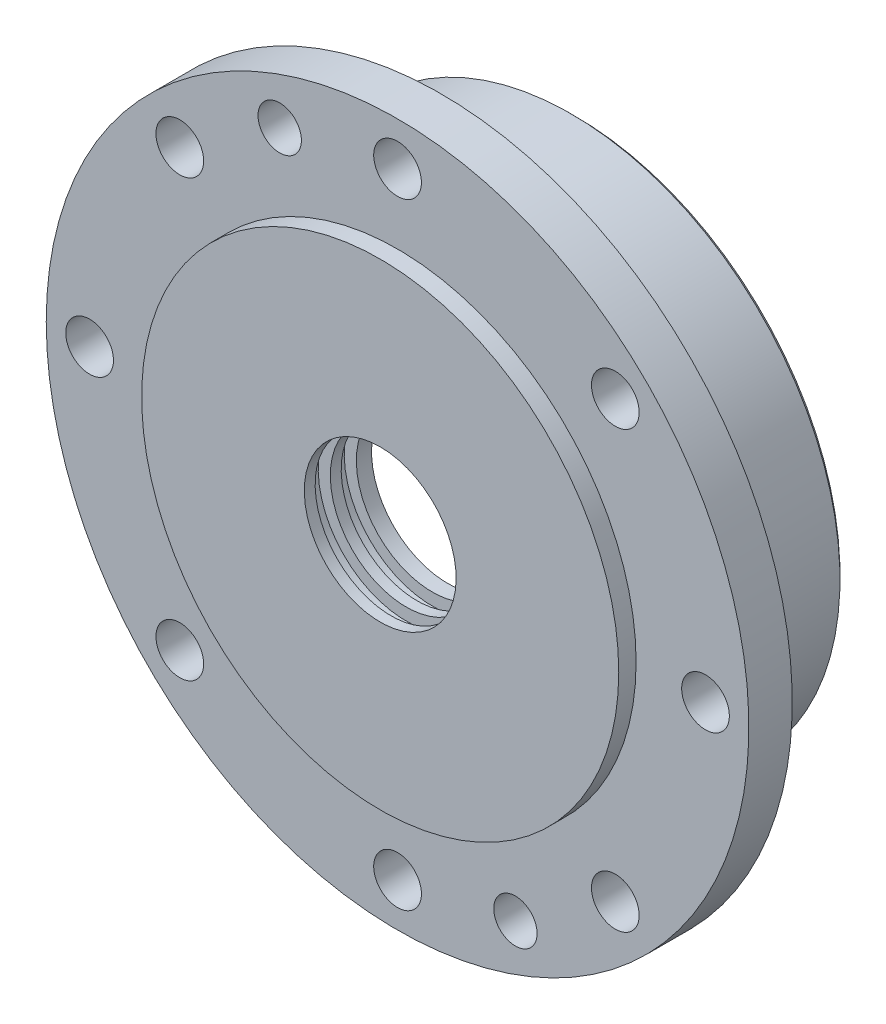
ISO-10303-21;
HEADER;
FILE_DESCRIPTION(('STEP AP214'),'2;1');
FILE_NAME('part.step','',(''),(''),'','','');
FILE_SCHEMA(('AUTOMOTIVE_DESIGN { 1 0 10303 214 1 1 1 1 }'));
ENDSEC;
DATA;
#1=APPLICATION_CONTEXT('core data for automotive mechanical design processes');
#2=APPLICATION_PROTOCOL_DEFINITION('international standard','automotive_design',2000,#1);
#3=PRODUCT_CONTEXT('',#1,'mechanical');
#4=PRODUCT('Part','Part','',(#3));
#5=PRODUCT_RELATED_PRODUCT_CATEGORY('part','',(#4));
#6=PRODUCT_DEFINITION_FORMATION('','',#4);
#7=PRODUCT_DEFINITION_CONTEXT('part definition',#1,'design');
#8=PRODUCT_DEFINITION('design','',#6,#7);
#9=PRODUCT_DEFINITION_SHAPE('','',#8);
#10=(LENGTH_UNIT() NAMED_UNIT(*) SI_UNIT(.MILLI.,.METRE.));
#11=(NAMED_UNIT(*) PLANE_ANGLE_UNIT() SI_UNIT($,.RADIAN.));
#12=(NAMED_UNIT(*) SI_UNIT($,.STERADIAN.) SOLID_ANGLE_UNIT());
#13=UNCERTAINTY_MEASURE_WITH_UNIT(LENGTH_MEASURE(1.E-05),#10,'distance_accuracy_value','');
#14=(GEOMETRIC_REPRESENTATION_CONTEXT(3) GLOBAL_UNCERTAINTY_ASSIGNED_CONTEXT((#13)) GLOBAL_UNIT_ASSIGNED_CONTEXT((#10,
#11,#12)) REPRESENTATION_CONTEXT('',''));
#15=CARTESIAN_POINT('',(0.,0.,0.));
#16=DIRECTION('',(0.,0.,1.));
#17=DIRECTION('',(1.,0.,0.));
#18=AXIS2_PLACEMENT_3D('',#15,#16,#17);
#19=CARTESIAN_POINT('',(0.,0.,4.));
#20=DIRECTION('',(0.,0.,-1.));
#21=DIRECTION('',(-1.,0.,0.));
#22=AXIS2_PLACEMENT_3D('',#19,#20,#21);
#23=CYLINDRICAL_SURFACE('',#22,55.);
#24=CARTESIAN_POINT('',(0.,0.,4.));
#25=DIRECTION('',(0.,0.,1.));
#26=DIRECTION('',(1.,0.,0.));
#27=AXIS2_PLACEMENT_3D('',#24,#25,#26);
#28=CIRCLE('',#27,55.);
#29=CARTESIAN_POINT('',(55.,0.,4.));
#30=VERTEX_POINT('',#29);
#31=EDGE_CURVE('E54',#30,#30,#28,.T.);
#32=ORIENTED_EDGE('',*,*,#31,.F.);
#33=EDGE_LOOP('',(#32));
#34=FACE_BOUND('',#33,.T.);
#35=CARTESIAN_POINT('',(0.,0.,0.));
#36=DIRECTION('',(0.,0.,1.));
#37=DIRECTION('',(1.,0.,0.));
#38=AXIS2_PLACEMENT_3D('',#35,#36,#37);
#39=CIRCLE('',#38,55.);
#40=CARTESIAN_POINT('',(55.,0.,0.));
#41=VERTEX_POINT('',#40);
#42=EDGE_CURVE('E62',#41,#41,#39,.T.);
#43=ORIENTED_EDGE('',*,*,#42,.T.);
#44=EDGE_LOOP('',(#43));
#45=FACE_BOUND('',#44,.T.);
#46=ADVANCED_FACE('F39',(#34,#45),#23,.T.);
#47=CARTESIAN_POINT('',(0.,0.,4.));
#48=DIRECTION('',(0.,0.,1.));
#49=DIRECTION('',(1.,0.,0.));
#50=AXIS2_PLACEMENT_3D('',#47,#48,#49);
#51=PLANE('',#50);
#52=CARTESIAN_POINT('',(0.,0.,4.00000000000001));
#53=DIRECTION('',(0.,0.,-1.));
#54=DIRECTION('',(0.,1.,0.));
#55=AXIS2_PLACEMENT_3D('',#52,#53,#54);
#56=CIRCLE('',#55,17.5);
#57=CARTESIAN_POINT('',(0.,17.5,4.00000000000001));
#58=VERTEX_POINT('',#57);
#59=EDGE_CURVE('E61',#58,#58,#56,.T.);
#60=ORIENTED_EDGE('',*,*,#59,.T.);
#61=EDGE_LOOP('',(#60));
#62=FACE_BOUND('',#61,.T.);
#63=ORIENTED_EDGE('',*,*,#31,.T.);
#64=EDGE_LOOP('',(#63));
#65=FACE_BOUND('',#64,.T.);
#66=ADVANCED_FACE('F225',(#62,#65),#51,.T.);
#67=CARTESIAN_POINT('',(0.,0.,-10.));
#68=DIRECTION('',(0.,0.,1.));
#69=DIRECTION('',(1.,0.,0.));
#70=AXIS2_PLACEMENT_3D('',#67,#68,#69);
#71=CYLINDRICAL_SURFACE('',#70,81.);
#72=CARTESIAN_POINT('',(0.,0.,-10.));
#73=DIRECTION('',(0.,0.,-1.));
#74=DIRECTION('',(-1.,0.,0.));
#75=AXIS2_PLACEMENT_3D('',#72,#73,#74);
#76=CIRCLE('',#75,81.);
#77=CARTESIAN_POINT('',(-81.,0.,-10.));
#78=VERTEX_POINT('',#77);
#79=EDGE_CURVE('E68',#78,#78,#76,.T.);
#80=ORIENTED_EDGE('',*,*,#79,.F.);
#81=EDGE_LOOP('',(#80));
#82=FACE_BOUND('',#81,.T.);
#83=CARTESIAN_POINT('',(0.,0.,0.));
#84=DIRECTION('',(0.,0.,-1.));
#85=DIRECTION('',(-1.,0.,0.));
#86=AXIS2_PLACEMENT_3D('',#83,#84,#85);
#87=CIRCLE('',#86,81.);
#88=CARTESIAN_POINT('',(-81.,0.,0.));
#89=VERTEX_POINT('',#88);
#90=EDGE_CURVE('E67',#89,#89,#87,.T.);
#91=ORIENTED_EDGE('',*,*,#90,.T.);
#92=EDGE_LOOP('',(#91));
#93=FACE_BOUND('',#92,.T.);
#94=ADVANCED_FACE('F219',(#82,#93),#71,.T.);
#95=CARTESIAN_POINT('',(0.,0.,-10.));
#96=DIRECTION('',(0.,0.,-1.));
#97=DIRECTION('',(-1.,0.,0.));
#98=AXIS2_PLACEMENT_3D('',#95,#96,#97);
#99=PLANE('',#98);
#100=CARTESIAN_POINT('',(-27.1705236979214,65.5954468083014,-10.));
#101=DIRECTION('',(0.,0.,-1.));
#102=DIRECTION('',(-1.,0.,0.));
#103=AXIS2_PLACEMENT_3D('',#100,#101,#102);
#104=CIRCLE('',#103,5.);
#105=CARTESIAN_POINT('',(-32.1705236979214,65.5954468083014,-10.));
#106=VERTEX_POINT('',#105);
#107=EDGE_CURVE('E158',#106,#106,#104,.T.);
#108=ORIENTED_EDGE('',*,*,#107,.F.);
#109=EDGE_LOOP('',(#108));
#110=FACE_BOUND('',#109,.T.);
#111=CARTESIAN_POINT('',(27.170523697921,-65.5954468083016,-10.));
#112=DIRECTION('',(0.,0.,-1.));
#113=DIRECTION('',(-1.,0.,0.));
#114=AXIS2_PLACEMENT_3D('',#111,#112,#113);
#115=CIRCLE('',#114,5.);
#116=CARTESIAN_POINT('',(22.170523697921,-65.5954468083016,-10.));
#117=VERTEX_POINT('',#116);
#118=EDGE_CURVE('E179',#117,#117,#115,.T.);
#119=ORIENTED_EDGE('',*,*,#118,.F.);
#120=EDGE_LOOP('',(#119));
#121=FACE_BOUND('',#120,.T.);
#122=CARTESIAN_POINT('',(0.,71.,-10.));
#123=DIRECTION('',(0.,0.,-1.));
#124=DIRECTION('',(-1.,0.,0.));
#125=AXIS2_PLACEMENT_3D('',#122,#123,#124);
#126=CIRCLE('',#125,5.5);
#127=CARTESIAN_POINT('',(-5.5,71.,-10.));
#128=VERTEX_POINT('',#127);
#129=EDGE_CURVE('E65',#128,#128,#126,.T.);
#130=ORIENTED_EDGE('',*,*,#129,.F.);
#131=EDGE_LOOP('',(#130));
#132=FACE_BOUND('',#131,.T.);
#133=CARTESIAN_POINT('',(50.204581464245,50.2045814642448,-10.));
#134=DIRECTION('',(0.,0.,-1.));
#135=DIRECTION('',(-1.,0.,0.));
#136=AXIS2_PLACEMENT_3D('',#133,#134,#135);
#137=CIRCLE('',#136,5.5);
#138=CARTESIAN_POINT('',(44.704581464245,50.2045814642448,-10.));
#139=VERTEX_POINT('',#138);
#140=EDGE_CURVE('E135',#139,#139,#137,.T.);
#141=ORIENTED_EDGE('',*,*,#140,.F.);
#142=EDGE_LOOP('',(#141));
#143=FACE_BOUND('',#142,.T.);
#144=CARTESIAN_POINT('',(71.,-2.47895175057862E-13,-10.));
#145=DIRECTION('',(0.,0.,-1.));
#146=DIRECTION('',(-1.,0.,0.));
#147=AXIS2_PLACEMENT_3D('',#144,#145,#146);
#148=CIRCLE('',#147,5.5);
#149=CARTESIAN_POINT('',(65.5,-2.47895175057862E-13,-10.));
#150=VERTEX_POINT('',#149);
#151=EDGE_CURVE('E134',#150,#150,#148,.T.);
#152=ORIENTED_EDGE('',*,*,#151,.F.);
#153=EDGE_LOOP('',(#152));
#154=FACE_BOUND('',#153,.T.);
#155=CARTESIAN_POINT('',(50.2045814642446,-50.2045814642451,-10.));
#156=DIRECTION('',(0.,0.,-1.));
#157=DIRECTION('',(-1.,0.,0.));
#158=AXIS2_PLACEMENT_3D('',#155,#156,#157);
#159=CIRCLE('',#158,5.50000000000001);
#160=CARTESIAN_POINT('',(44.7045814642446,-50.2045814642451,-10.));
#161=VERTEX_POINT('',#160);
#162=EDGE_CURVE('E136',#161,#161,#159,.T.);
#163=ORIENTED_EDGE('',*,*,#162,.F.);
#164=EDGE_LOOP('',(#163));
#165=FACE_BOUND('',#164,.T.);
#166=CARTESIAN_POINT('',(-4.95790350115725E-13,-71.,-10.));
#167=DIRECTION('',(0.,0.,-1.));
#168=DIRECTION('',(-1.,0.,0.));
#169=AXIS2_PLACEMENT_3D('',#166,#167,#168);
#170=CIRCLE('',#169,5.5);
#171=CARTESIAN_POINT('',(-5.5000000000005,-71.,-10.));
#172=VERTEX_POINT('',#171);
#173=EDGE_CURVE('E143',#172,#172,#170,.T.);
#174=ORIENTED_EDGE('',*,*,#173,.F.);
#175=EDGE_LOOP('',(#174));
#176=FACE_BOUND('',#175,.T.);
#177=CARTESIAN_POINT('',(-50.2045814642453,-50.2045814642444,-10.));
#178=DIRECTION('',(0.,0.,-1.));
#179=DIRECTION('',(-1.,0.,0.));
#180=AXIS2_PLACEMENT_3D('',#177,#178,#179);
#181=CIRCLE('',#180,5.50000000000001);
#182=CARTESIAN_POINT('',(-55.7045814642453,-50.2045814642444,-10.));
#183=VERTEX_POINT('',#182);
#184=EDGE_CURVE('E145',#183,#183,#181,.T.);
#185=ORIENTED_EDGE('',*,*,#184,.F.);
#186=EDGE_LOOP('',(#185));
#187=FACE_BOUND('',#186,.T.);
#188=CARTESIAN_POINT('',(-71.,7.43685525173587E-13,-10.));
#189=DIRECTION('',(0.,0.,-1.));
#190=DIRECTION('',(-1.,0.,0.));
#191=AXIS2_PLACEMENT_3D('',#188,#189,#190);
#192=CIRCLE('',#191,5.5);
#193=CARTESIAN_POINT('',(-76.5,7.43685525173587E-13,-10.));
#194=VERTEX_POINT('',#193);
#195=EDGE_CURVE('E150',#194,#194,#192,.T.);
#196=ORIENTED_EDGE('',*,*,#195,.F.);
#197=EDGE_LOOP('',(#196));
#198=FACE_BOUND('',#197,.T.);
#199=CARTESIAN_POINT('',(-50.2045814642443,50.2045814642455,-10.));
#200=DIRECTION('',(0.,0.,-1.));
#201=DIRECTION('',(-1.,0.,0.));
#202=AXIS2_PLACEMENT_3D('',#199,#200,#201);
#203=CIRCLE('',#202,5.5);
#204=CARTESIAN_POINT('',(-55.7045814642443,50.2045814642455,-10.));
#205=VERTEX_POINT('',#204);
#206=EDGE_CURVE('E147',#205,#205,#203,.T.);
#207=ORIENTED_EDGE('',*,*,#206,.F.);
#208=EDGE_LOOP('',(#207));
#209=FACE_BOUND('',#208,.T.);
#210=CARTESIAN_POINT('',(0.,0.,-10.));
#211=DIRECTION('',(0.,0.,-1.));
#212=DIRECTION('',(-1.,0.,0.));
#213=AXIS2_PLACEMENT_3D('',#210,#211,#212);
#214=CIRCLE('',#213,62.);
#215=CARTESIAN_POINT('',(-62.,0.,-10.));
#216=VERTEX_POINT('',#215);
#217=EDGE_CURVE('E51',#216,#216,#214,.T.);
#218=ORIENTED_EDGE('',*,*,#217,.F.);
#219=EDGE_LOOP('',(#218));
#220=FACE_BOUND('',#219,.T.);
#221=ORIENTED_EDGE('',*,*,#79,.T.);
#222=EDGE_LOOP('',(#221));
#223=FACE_BOUND('',#222,.T.);
#224=ADVANCED_FACE('F198',(#110,#121,#132,#143,#154,#165,#176,#187,#198,#209,#220,#223),#99,.T.);
#225=CARTESIAN_POINT('',(0.,0.,0.));
#226=DIRECTION('',(0.,0.,-1.));
#227=DIRECTION('',(-1.,0.,0.));
#228=AXIS2_PLACEMENT_3D('',#225,#226,#227);
#229=PLANE('',#228);
#230=CARTESIAN_POINT('',(-27.1705236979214,65.5954468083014,0.));
#231=DIRECTION('',(0.,0.,1.));
#232=DIRECTION('',(1.,0.,0.));
#233=AXIS2_PLACEMENT_3D('',#230,#231,#232);
#234=CIRCLE('',#233,5.);
#235=CARTESIAN_POINT('',(-22.1705236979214,65.5954468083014,0.));
#236=VERTEX_POINT('',#235);
#237=EDGE_CURVE('E181',#236,#236,#234,.T.);
#238=ORIENTED_EDGE('',*,*,#237,.F.);
#239=EDGE_LOOP('',(#238));
#240=FACE_BOUND('',#239,.T.);
#241=CARTESIAN_POINT('',(27.170523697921,-65.5954468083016,0.));
#242=DIRECTION('',(0.,0.,1.));
#243=DIRECTION('',(1.,0.,0.));
#244=AXIS2_PLACEMENT_3D('',#241,#242,#243);
#245=CIRCLE('',#244,5.);
#246=CARTESIAN_POINT('',(32.170523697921,-65.5954468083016,0.));
#247=VERTEX_POINT('',#246);
#248=EDGE_CURVE('E184',#247,#247,#245,.T.);
#249=ORIENTED_EDGE('',*,*,#248,.F.);
#250=EDGE_LOOP('',(#249));
#251=FACE_BOUND('',#250,.T.);
#252=CARTESIAN_POINT('',(0.,71.,0.));
#253=DIRECTION('',(0.,0.,1.));
#254=DIRECTION('',(1.,0.,0.));
#255=AXIS2_PLACEMENT_3D('',#252,#253,#254);
#256=CIRCLE('',#255,5.5);
#257=CARTESIAN_POINT('',(5.5,71.,0.));
#258=VERTEX_POINT('',#257);
#259=EDGE_CURVE('E153',#258,#258,#256,.T.);
#260=ORIENTED_EDGE('',*,*,#259,.F.);
#261=EDGE_LOOP('',(#260));
#262=FACE_BOUND('',#261,.T.);
#263=CARTESIAN_POINT('',(50.204581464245,50.2045814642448,0.));
#264=DIRECTION('',(0.,0.,1.));
#265=DIRECTION('',(1.,0.,0.));
#266=AXIS2_PLACEMENT_3D('',#263,#264,#265);
#267=CIRCLE('',#266,5.5);
#268=CARTESIAN_POINT('',(55.704581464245,50.2045814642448,0.));
#269=VERTEX_POINT('',#268);
#270=EDGE_CURVE('E172',#269,#269,#267,.T.);
#271=ORIENTED_EDGE('',*,*,#270,.F.);
#272=EDGE_LOOP('',(#271));
#273=FACE_BOUND('',#272,.T.);
#274=CARTESIAN_POINT('',(71.,-2.47895175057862E-13,0.));
#275=DIRECTION('',(0.,0.,1.));
#276=DIRECTION('',(1.,0.,0.));
#277=AXIS2_PLACEMENT_3D('',#274,#275,#276);
#278=CIRCLE('',#277,5.5);
#279=CARTESIAN_POINT('',(76.5,-2.47895175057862E-13,0.));
#280=VERTEX_POINT('',#279);
#281=EDGE_CURVE('E168',#280,#280,#278,.T.);
#282=ORIENTED_EDGE('',*,*,#281,.F.);
#283=EDGE_LOOP('',(#282));
#284=FACE_BOUND('',#283,.T.);
#285=CARTESIAN_POINT('',(50.2045814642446,-50.2045814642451,0.));
#286=DIRECTION('',(0.,0.,1.));
#287=DIRECTION('',(1.,0.,0.));
#288=AXIS2_PLACEMENT_3D('',#285,#286,#287);
#289=CIRCLE('',#288,5.50000000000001);
#290=CARTESIAN_POINT('',(55.7045814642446,-50.2045814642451,0.));
#291=VERTEX_POINT('',#290);
#292=EDGE_CURVE('E170',#291,#291,#289,.T.);
#293=ORIENTED_EDGE('',*,*,#292,.F.);
#294=EDGE_LOOP('',(#293));
#295=FACE_BOUND('',#294,.T.);
#296=CARTESIAN_POINT('',(-4.95790350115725E-13,-71.,0.));
#297=DIRECTION('',(0.,0.,1.));
#298=DIRECTION('',(1.,0.,0.));
#299=AXIS2_PLACEMENT_3D('',#296,#297,#298);
#300=CIRCLE('',#299,5.5);
#301=CARTESIAN_POINT('',(5.4999999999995,-71.,0.));
#302=VERTEX_POINT('',#301);
#303=EDGE_CURVE('E163',#302,#302,#300,.T.);
#304=ORIENTED_EDGE('',*,*,#303,.F.);
#305=EDGE_LOOP('',(#304));
#306=FACE_BOUND('',#305,.T.);
#307=CARTESIAN_POINT('',(-50.2045814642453,-50.2045814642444,0.));
#308=DIRECTION('',(0.,0.,1.));
#309=DIRECTION('',(1.,0.,0.));
#310=AXIS2_PLACEMENT_3D('',#307,#308,#309);
#311=CIRCLE('',#310,5.50000000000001);
#312=CARTESIAN_POINT('',(-44.7045814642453,-50.2045814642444,0.));
#313=VERTEX_POINT('',#312);
#314=EDGE_CURVE('E161',#313,#313,#311,.T.);
#315=ORIENTED_EDGE('',*,*,#314,.F.);
#316=EDGE_LOOP('',(#315));
#317=FACE_BOUND('',#316,.T.);
#318=CARTESIAN_POINT('',(-71.,7.43685525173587E-13,0.));
#319=DIRECTION('',(0.,0.,1.));
#320=DIRECTION('',(1.,0.,0.));
#321=AXIS2_PLACEMENT_3D('',#318,#319,#320);
#322=CIRCLE('',#321,5.5);
#323=CARTESIAN_POINT('',(-65.5,7.43685525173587E-13,0.));
#324=VERTEX_POINT('',#323);
#325=EDGE_CURVE('E160',#324,#324,#322,.T.);
#326=ORIENTED_EDGE('',*,*,#325,.F.);
#327=EDGE_LOOP('',(#326));
#328=FACE_BOUND('',#327,.T.);
#329=CARTESIAN_POINT('',(-50.2045814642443,50.2045814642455,0.));
#330=DIRECTION('',(0.,0.,1.));
#331=DIRECTION('',(1.,0.,0.));
#332=AXIS2_PLACEMENT_3D('',#329,#330,#331);
#333=CIRCLE('',#332,5.5);
#334=CARTESIAN_POINT('',(-44.7045814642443,50.2045814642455,0.));
#335=VERTEX_POINT('',#334);
#336=EDGE_CURVE('E152',#335,#335,#333,.T.);
#337=ORIENTED_EDGE('',*,*,#336,.F.);
#338=EDGE_LOOP('',(#337));
#339=FACE_BOUND('',#338,.T.);
#340=ORIENTED_EDGE('',*,*,#42,.F.);
#341=EDGE_LOOP('',(#340));
#342=FACE_BOUND('',#341,.T.);
#343=ORIENTED_EDGE('',*,*,#90,.F.);
#344=EDGE_LOOP('',(#343));
#345=FACE_BOUND('',#344,.T.);
#346=ADVANCED_FACE('F195',(#240,#251,#262,#273,#284,#295,#306,#317,#328,#339,#342,#345),#229,.F.);
#347=CARTESIAN_POINT('',(0.,0.,-41.));
#348=DIRECTION('',(0.,0.,1.));
#349=DIRECTION('',(1.,0.,0.));
#350=AXIS2_PLACEMENT_3D('',#347,#348,#349);
#351=CYLINDRICAL_SURFACE('',#350,62.);
#352=CARTESIAN_POINT('',(0.,0.,-40.));
#353=DIRECTION('',(0.,0.,-1.));
#354=DIRECTION('',(-1.,0.,0.));
#355=AXIS2_PLACEMENT_3D('',#352,#353,#354);
#356=CIRCLE('',#355,62.);
#357=CARTESIAN_POINT('',(-62.,0.,-40.));
#358=VERTEX_POINT('',#357);
#359=EDGE_CURVE('E10',#358,#358,#356,.F.);
#360=ORIENTED_EDGE('',*,*,#359,.T.);
#361=EDGE_LOOP('',(#360));
#362=FACE_BOUND('',#361,.T.);
#363=ORIENTED_EDGE('',*,*,#217,.T.);
#364=EDGE_LOOP('',(#363));
#365=FACE_BOUND('',#364,.T.);
#366=ADVANCED_FACE('F194',(#362,#365),#351,.T.);
#367=CARTESIAN_POINT('',(0.,0.,-41.));
#368=DIRECTION('',(0.,0.,-1.));
#369=DIRECTION('',(-1.,0.,0.));
#370=AXIS2_PLACEMENT_3D('',#367,#368,#369);
#371=PLANE('',#370);
#372=CARTESIAN_POINT('',(0.,0.,-41.));
#373=DIRECTION('',(0.,0.,-1.));
#374=DIRECTION('',(-1.,0.,0.));
#375=AXIS2_PLACEMENT_3D('',#372,#373,#374);
#376=CIRCLE('',#375,61.);
#377=CARTESIAN_POINT('',(-61.,0.,-41.));
#378=VERTEX_POINT('',#377);
#379=EDGE_CURVE('E50',#378,#378,#376,.T.);
#380=ORIENTED_EDGE('',*,*,#379,.T.);
#381=EDGE_LOOP('',(#380));
#382=FACE_BOUND('',#381,.T.);
#383=CARTESIAN_POINT('',(0.,0.,-41.));
#384=DIRECTION('',(0.,0.,1.));
#385=DIRECTION('',(1.,0.,0.));
#386=AXIS2_PLACEMENT_3D('',#383,#384,#385);
#387=CIRCLE('',#386,60.);
#388=CARTESIAN_POINT('',(60.,0.,-41.));
#389=VERTEX_POINT('',#388);
#390=EDGE_CURVE('E101',#389,#389,#387,.T.);
#391=ORIENTED_EDGE('',*,*,#390,.T.);
#392=EDGE_LOOP('',(#391));
#393=FACE_BOUND('',#392,.T.);
#394=ADVANCED_FACE('F279',(#382,#393),#371,.T.);
#395=CARTESIAN_POINT('',(0.,0.,0.));
#396=DIRECTION('',(0.,0.,1.));
#397=DIRECTION('',(1.,0.,0.));
#398=AXIS2_PLACEMENT_3D('',#395,#396,#397);
#399=CYLINDRICAL_SURFACE('',#398,60.);
#400=CARTESIAN_POINT('',(0.,0.,-32.));
#401=DIRECTION('',(0.,0.,1.));
#402=DIRECTION('',(1.,0.,0.));
#403=AXIS2_PLACEMENT_3D('',#400,#401,#402);
#404=CIRCLE('',#403,60.);
#405=CARTESIAN_POINT('',(60.,0.,-32.));
#406=VERTEX_POINT('',#405);
#407=EDGE_CURVE('E75',#406,#406,#404,.T.);
#408=ORIENTED_EDGE('',*,*,#407,.T.);
#409=EDGE_LOOP('',(#408));
#410=FACE_BOUND('',#409,.T.);
#411=ORIENTED_EDGE('',*,*,#390,.F.);
#412=EDGE_LOOP('',(#411));
#413=FACE_BOUND('',#412,.T.);
#414=ADVANCED_FACE('F286',(#410,#413),#399,.F.);
#415=CARTESIAN_POINT('',(0.,0.,-32.));
#416=DIRECTION('',(0.,0.,1.));
#417=DIRECTION('',(1.,0.,0.));
#418=AXIS2_PLACEMENT_3D('',#415,#416,#417);
#419=PLANE('',#418);
#420=CARTESIAN_POINT('',(0.,0.,-32.));
#421=DIRECTION('',(0.,0.,1.));
#422=DIRECTION('',(1.,0.,0.));
#423=AXIS2_PLACEMENT_3D('',#420,#421,#422);
#424=CIRCLE('',#423,60.5);
#425=CARTESIAN_POINT('',(60.5,0.,-32.));
#426=VERTEX_POINT('',#425);
#427=EDGE_CURVE('E80',#426,#426,#424,.T.);
#428=ORIENTED_EDGE('',*,*,#427,.T.);
#429=EDGE_LOOP('',(#428));
#430=FACE_BOUND('',#429,.T.);
#431=ORIENTED_EDGE('',*,*,#407,.F.);
#432=EDGE_LOOP('',(#431));
#433=FACE_BOUND('',#432,.T.);
#434=ADVANCED_FACE('F300',(#430,#433),#419,.T.);
#435=CARTESIAN_POINT('',(0.,0.,0.));
#436=DIRECTION('',(0.,0.,1.));
#437=DIRECTION('',(1.,0.,0.));
#438=AXIS2_PLACEMENT_3D('',#435,#436,#437);
#439=CYLINDRICAL_SURFACE('',#438,60.5);
#440=CARTESIAN_POINT('',(0.,0.,-29.));
#441=DIRECTION('',(0.,0.,1.));
#442=DIRECTION('',(1.,0.,0.));
#443=AXIS2_PLACEMENT_3D('',#440,#441,#442);
#444=CIRCLE('',#443,60.5);
#445=CARTESIAN_POINT('',(60.5,0.,-29.));
#446=VERTEX_POINT('',#445);
#447=EDGE_CURVE('E79',#446,#446,#444,.T.);
#448=ORIENTED_EDGE('',*,*,#447,.T.);
#449=EDGE_LOOP('',(#448));
#450=FACE_BOUND('',#449,.T.);
#451=ORIENTED_EDGE('',*,*,#427,.F.);
#452=EDGE_LOOP('',(#451));
#453=FACE_BOUND('',#452,.T.);
#454=ADVANCED_FACE('F307',(#450,#453),#439,.F.);
#455=CARTESIAN_POINT('',(0.,0.,-29.));
#456=DIRECTION('',(0.,0.,1.));
#457=DIRECTION('',(1.,0.,0.));
#458=AXIS2_PLACEMENT_3D('',#455,#456,#457);
#459=PLANE('',#458);
#460=ORIENTED_EDGE('',*,*,#447,.F.);
#461=EDGE_LOOP('',(#460));
#462=FACE_BOUND('',#461,.T.);
#463=CARTESIAN_POINT('',(0.,0.,-29.));
#464=DIRECTION('',(0.,0.,1.));
#465=DIRECTION('',(1.,0.,0.));
#466=AXIS2_PLACEMENT_3D('',#463,#464,#465);
#467=CIRCLE('',#466,57.5);
#468=CARTESIAN_POINT('',(57.5,0.,-29.));
#469=VERTEX_POINT('',#468);
#470=EDGE_CURVE('E81',#469,#469,#467,.T.);
#471=ORIENTED_EDGE('',*,*,#470,.T.);
#472=EDGE_LOOP('',(#471));
#473=FACE_BOUND('',#472,.T.);
#474=ADVANCED_FACE('F319',(#462,#473),#459,.F.);
#475=CARTESIAN_POINT('',(0.,0.,0.));
#476=DIRECTION('',(0.,0.,1.));
#477=DIRECTION('',(1.,0.,0.));
#478=AXIS2_PLACEMENT_3D('',#475,#476,#477);
#479=CYLINDRICAL_SURFACE('',#478,57.5);
#480=CARTESIAN_POINT('',(0.,0.,-13.5));
#481=DIRECTION('',(0.,0.,1.));
#482=DIRECTION('',(1.,0.,0.));
#483=AXIS2_PLACEMENT_3D('',#480,#481,#482);
#484=CIRCLE('',#483,57.5);
#485=CARTESIAN_POINT('',(57.5,0.,-13.5));
#486=VERTEX_POINT('',#485);
#487=EDGE_CURVE('E88',#486,#486,#484,.T.);
#488=ORIENTED_EDGE('',*,*,#487,.T.);
#489=EDGE_LOOP('',(#488));
#490=FACE_BOUND('',#489,.T.);
#491=ORIENTED_EDGE('',*,*,#470,.F.);
#492=EDGE_LOOP('',(#491));
#493=FACE_BOUND('',#492,.T.);
#494=ADVANCED_FACE('F329',(#490,#493),#479,.F.);
#495=CARTESIAN_POINT('',(0.,0.,-13.5));
#496=DIRECTION('',(0.,0.,1.));
#497=DIRECTION('',(1.,0.,0.));
#498=AXIS2_PLACEMENT_3D('',#495,#496,#497);
#499=PLANE('',#498);
#500=CARTESIAN_POINT('',(0.,0.,-13.5));
#501=DIRECTION('',(0.,0.,1.));
#502=DIRECTION('',(1.,0.,0.));
#503=AXIS2_PLACEMENT_3D('',#500,#501,#502);
#504=CIRCLE('',#503,58.);
#505=CARTESIAN_POINT('',(58.,0.,-13.5));
#506=VERTEX_POINT('',#505);
#507=EDGE_CURVE('E90',#506,#506,#504,.T.);
#508=ORIENTED_EDGE('',*,*,#507,.T.);
#509=EDGE_LOOP('',(#508));
#510=FACE_BOUND('',#509,.T.);
#511=ORIENTED_EDGE('',*,*,#487,.F.);
#512=EDGE_LOOP('',(#511));
#513=FACE_BOUND('',#512,.T.);
#514=ADVANCED_FACE('F341',(#510,#513),#499,.T.);
#515=CARTESIAN_POINT('',(0.,0.,0.));
#516=DIRECTION('',(0.,0.,1.));
#517=DIRECTION('',(1.,0.,0.));
#518=AXIS2_PLACEMENT_3D('',#515,#516,#517);
#519=CYLINDRICAL_SURFACE('',#518,58.);
#520=CARTESIAN_POINT('',(0.,0.,-12.));
#521=DIRECTION('',(0.,0.,1.));
#522=DIRECTION('',(1.,0.,0.));
#523=AXIS2_PLACEMENT_3D('',#520,#521,#522);
#524=CIRCLE('',#523,58.);
#525=CARTESIAN_POINT('',(58.,0.,-12.));
#526=VERTEX_POINT('',#525);
#527=EDGE_CURVE('E95',#526,#526,#524,.T.);
#528=ORIENTED_EDGE('',*,*,#527,.T.);
#529=EDGE_LOOP('',(#528));
#530=FACE_BOUND('',#529,.T.);
#531=ORIENTED_EDGE('',*,*,#507,.F.);
#532=EDGE_LOOP('',(#531));
#533=FACE_BOUND('',#532,.T.);
#534=ADVANCED_FACE('F352',(#530,#533),#519,.F.);
#535=CARTESIAN_POINT('',(0.,0.,-12.));
#536=DIRECTION('',(0.,0.,1.));
#537=DIRECTION('',(1.,0.,0.));
#538=AXIS2_PLACEMENT_3D('',#535,#536,#537);
#539=PLANE('',#538);
#540=ORIENTED_EDGE('',*,*,#527,.F.);
#541=EDGE_LOOP('',(#540));
#542=FACE_BOUND('',#541,.T.);
#543=CARTESIAN_POINT('',(0.,0.,-12.));
#544=DIRECTION('',(0.,0.,1.));
#545=DIRECTION('',(1.,0.,0.));
#546=AXIS2_PLACEMENT_3D('',#543,#544,#545);
#547=CIRCLE('',#546,50.);
#548=CARTESIAN_POINT('',(50.,0.,-12.));
#549=VERTEX_POINT('',#548);
#550=EDGE_CURVE('E92',#549,#549,#547,.T.);
#551=ORIENTED_EDGE('',*,*,#550,.T.);
#552=EDGE_LOOP('',(#551));
#553=FACE_BOUND('',#552,.T.);
#554=ADVANCED_FACE('F368',(#542,#553),#539,.F.);
#555=CARTESIAN_POINT('',(0.,0.,0.));
#556=DIRECTION('',(0.,0.,1.));
#557=DIRECTION('',(1.,0.,0.));
#558=AXIS2_PLACEMENT_3D('',#555,#556,#557);
#559=CYLINDRICAL_SURFACE('',#558,50.);
#560=CARTESIAN_POINT('',(0.,0.,-11.5));
#561=DIRECTION('',(0.,0.,1.));
#562=DIRECTION('',(1.,0.,0.));
#563=AXIS2_PLACEMENT_3D('',#560,#561,#562);
#564=CIRCLE('',#563,50.);
#565=CARTESIAN_POINT('',(50.,0.,-11.5));
#566=VERTEX_POINT('',#565);
#567=EDGE_CURVE('E98',#566,#566,#564,.T.);
#568=ORIENTED_EDGE('',*,*,#567,.T.);
#569=EDGE_LOOP('',(#568));
#570=FACE_BOUND('',#569,.T.);
#571=ORIENTED_EDGE('',*,*,#550,.F.);
#572=EDGE_LOOP('',(#571));
#573=FACE_BOUND('',#572,.T.);
#574=ADVANCED_FACE('F376',(#570,#573),#559,.F.);
#575=CARTESIAN_POINT('',(0.,0.,-11.5));
#576=DIRECTION('',(0.,0.,1.));
#577=DIRECTION('',(1.,0.,0.));
#578=AXIS2_PLACEMENT_3D('',#575,#576,#577);
#579=PLANE('',#578);
#580=CARTESIAN_POINT('',(0.,0.,-11.5));
#581=DIRECTION('',(0.,0.,1.));
#582=DIRECTION('',(1.,0.,0.));
#583=AXIS2_PLACEMENT_3D('',#580,#581,#582);
#584=CIRCLE('',#583,17.5);
#585=CARTESIAN_POINT('',(17.5,0.,-11.5));
#586=VERTEX_POINT('',#585);
#587=EDGE_CURVE('E59',#586,#586,#584,.T.);
#588=ORIENTED_EDGE('',*,*,#587,.T.);
#589=EDGE_LOOP('',(#588));
#590=FACE_BOUND('',#589,.T.);
#591=ORIENTED_EDGE('',*,*,#567,.F.);
#592=EDGE_LOOP('',(#591));
#593=FACE_BOUND('',#592,.T.);
#594=ADVANCED_FACE('F389',(#590,#593),#579,.F.);
#595=CARTESIAN_POINT('',(0.,0.,0.));
#596=DIRECTION('',(0.,0.,-1.));
#597=DIRECTION('',(0.,1.,0.));
#598=AXIS2_PLACEMENT_3D('',#595,#596,#597);
#599=CYLINDRICAL_SURFACE('',#598,17.5);
#600=CARTESIAN_POINT('',(0.,0.,-7.99999999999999));
#601=DIRECTION('',(0.,0.,-1.));
#602=DIRECTION('',(0.,1.,0.));
#603=AXIS2_PLACEMENT_3D('',#600,#601,#602);
#604=CIRCLE('',#603,17.5);
#605=CARTESIAN_POINT('',(0.,17.5,-7.99999999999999));
#606=VERTEX_POINT('',#605);
#607=EDGE_CURVE('E102',#606,#606,#604,.T.);
#608=ORIENTED_EDGE('',*,*,#607,.F.);
#609=EDGE_LOOP('',(#608));
#610=FACE_BOUND('',#609,.T.);
#611=ORIENTED_EDGE('',*,*,#587,.F.);
#612=EDGE_LOOP('',(#611));
#613=FACE_BOUND('',#612,.T.);
#614=ADVANCED_FACE('F396',(#610,#613),#599,.F.);
#615=CARTESIAN_POINT('',(0.,0.,-7.99999999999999));
#616=DIRECTION('',(0.,0.,-1.));
#617=DIRECTION('',(0.,1.,0.));
#618=AXIS2_PLACEMENT_3D('',#615,#616,#617);
#619=PLANE('',#618);
#620=CARTESIAN_POINT('',(0.,0.,-7.99999999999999));
#621=DIRECTION('',(0.,0.,-1.));
#622=DIRECTION('',(0.,1.,0.));
#623=AXIS2_PLACEMENT_3D('',#620,#621,#622);
#624=CIRCLE('',#623,20.3);
#625=CARTESIAN_POINT('',(0.,20.3,-7.99999999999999));
#626=VERTEX_POINT('',#625);
#627=EDGE_CURVE('E110',#626,#626,#624,.T.);
#628=ORIENTED_EDGE('',*,*,#627,.F.);
#629=EDGE_LOOP('',(#628));
#630=FACE_BOUND('',#629,.T.);
#631=ORIENTED_EDGE('',*,*,#607,.T.);
#632=EDGE_LOOP('',(#631));
#633=FACE_BOUND('',#632,.T.);
#634=ADVANCED_FACE('F409',(#630,#633),#619,.F.);
#635=CARTESIAN_POINT('',(0.,0.,0.));
#636=DIRECTION('',(0.,0.,-1.));
#637=DIRECTION('',(0.,1.,0.));
#638=AXIS2_PLACEMENT_3D('',#635,#636,#637);
#639=CYLINDRICAL_SURFACE('',#638,20.3);
#640=ORIENTED_EDGE('',*,*,#627,.T.);
#641=EDGE_LOOP('',(#640));
#642=FACE_BOUND('',#641,.T.);
#643=CARTESIAN_POINT('',(0.,0.,-4.5));
#644=DIRECTION('',(0.,0.,-1.));
#645=DIRECTION('',(0.,1.,0.));
#646=AXIS2_PLACEMENT_3D('',#643,#644,#645);
#647=CIRCLE('',#646,20.3);
#648=CARTESIAN_POINT('',(0.,20.3,-4.49999999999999));
#649=VERTEX_POINT('',#648);
#650=EDGE_CURVE('E109',#649,#649,#647,.T.);
#651=ORIENTED_EDGE('',*,*,#650,.F.);
#652=EDGE_LOOP('',(#651));
#653=FACE_BOUND('',#652,.T.);
#654=ADVANCED_FACE('F425',(#642,#653),#639,.F.);
#655=CARTESIAN_POINT('',(0.,0.,-4.5));
#656=DIRECTION('',(0.,0.,-1.));
#657=DIRECTION('',(0.,1.,0.));
#658=AXIS2_PLACEMENT_3D('',#655,#656,#657);
#659=PLANE('',#658);
#660=ORIENTED_EDGE('',*,*,#650,.T.);
#661=EDGE_LOOP('',(#660));
#662=FACE_BOUND('',#661,.T.);
#663=CARTESIAN_POINT('',(0.,0.,-4.5));
#664=DIRECTION('',(0.,0.,-1.));
#665=DIRECTION('',(0.,1.,0.));
#666=AXIS2_PLACEMENT_3D('',#663,#664,#665);
#667=CIRCLE('',#666,17.5);
#668=CARTESIAN_POINT('',(0.,17.5,-4.49999999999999));
#669=VERTEX_POINT('',#668);
#670=EDGE_CURVE('E114',#669,#669,#667,.T.);
#671=ORIENTED_EDGE('',*,*,#670,.F.);
#672=EDGE_LOOP('',(#671));
#673=FACE_BOUND('',#672,.T.);
#674=ADVANCED_FACE('F434',(#662,#673),#659,.T.);
#675=CARTESIAN_POINT('',(0.,0.,0.));
#676=DIRECTION('',(0.,0.,-1.));
#677=DIRECTION('',(0.,1.,0.));
#678=AXIS2_PLACEMENT_3D('',#675,#676,#677);
#679=CYLINDRICAL_SURFACE('',#678,17.5);
#680=ORIENTED_EDGE('',*,*,#670,.T.);
#681=EDGE_LOOP('',(#680));
#682=FACE_BOUND('',#681,.T.);
#683=CARTESIAN_POINT('',(0.,0.,-2.));
#684=DIRECTION('',(0.,0.,-1.));
#685=DIRECTION('',(0.,1.,0.));
#686=AXIS2_PLACEMENT_3D('',#683,#684,#685);
#687=CIRCLE('',#686,17.5);
#688=CARTESIAN_POINT('',(0.,17.5,-1.99999999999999));
#689=VERTEX_POINT('',#688);
#690=EDGE_CURVE('E116',#689,#689,#687,.T.);
#691=ORIENTED_EDGE('',*,*,#690,.F.);
#692=EDGE_LOOP('',(#691));
#693=FACE_BOUND('',#692,.T.);
#694=ADVANCED_FACE('F443',(#682,#693),#679,.F.);
#695=CARTESIAN_POINT('',(0.,0.,-2.));
#696=DIRECTION('',(0.,0.,-1.));
#697=DIRECTION('',(0.,1.,0.));
#698=AXIS2_PLACEMENT_3D('',#695,#696,#697);
#699=PLANE('',#698);
#700=CARTESIAN_POINT('',(0.,0.,-2.));
#701=DIRECTION('',(0.,0.,-1.));
#702=DIRECTION('',(0.,1.,0.));
#703=AXIS2_PLACEMENT_3D('',#700,#701,#702);
#704=CIRCLE('',#703,20.3);
#705=CARTESIAN_POINT('',(0.,20.3,-1.99999999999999));
#706=VERTEX_POINT('',#705);
#707=EDGE_CURVE('E118',#706,#706,#704,.T.);
#708=ORIENTED_EDGE('',*,*,#707,.F.);
#709=EDGE_LOOP('',(#708));
#710=FACE_BOUND('',#709,.T.);
#711=ORIENTED_EDGE('',*,*,#690,.T.);
#712=EDGE_LOOP('',(#711));
#713=FACE_BOUND('',#712,.T.);
#714=ADVANCED_FACE('F456',(#710,#713),#699,.F.);
#715=CARTESIAN_POINT('',(0.,0.,0.));
#716=DIRECTION('',(0.,0.,-1.));
#717=DIRECTION('',(0.,1.,0.));
#718=AXIS2_PLACEMENT_3D('',#715,#716,#717);
#719=CYLINDRICAL_SURFACE('',#718,20.3);
#720=ORIENTED_EDGE('',*,*,#707,.T.);
#721=EDGE_LOOP('',(#720));
#722=FACE_BOUND('',#721,.T.);
#723=CARTESIAN_POINT('',(0.,0.,1.5));
#724=DIRECTION('',(0.,0.,-1.));
#725=DIRECTION('',(0.,1.,0.));
#726=AXIS2_PLACEMENT_3D('',#723,#724,#725);
#727=CIRCLE('',#726,20.3);
#728=CARTESIAN_POINT('',(0.,20.3,1.50000000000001));
#729=VERTEX_POINT('',#728);
#730=EDGE_CURVE('E125',#729,#729,#727,.T.);
#731=ORIENTED_EDGE('',*,*,#730,.F.);
#732=EDGE_LOOP('',(#731));
#733=FACE_BOUND('',#732,.T.);
#734=ADVANCED_FACE('F466',(#722,#733),#719,.F.);
#735=CARTESIAN_POINT('',(0.,0.,1.5));
#736=DIRECTION('',(0.,0.,-1.));
#737=DIRECTION('',(0.,1.,0.));
#738=AXIS2_PLACEMENT_3D('',#735,#736,#737);
#739=PLANE('',#738);
#740=ORIENTED_EDGE('',*,*,#730,.T.);
#741=EDGE_LOOP('',(#740));
#742=FACE_BOUND('',#741,.T.);
#743=CARTESIAN_POINT('',(0.,0.,1.5));
#744=DIRECTION('',(0.,0.,-1.));
#745=DIRECTION('',(0.,1.,0.));
#746=AXIS2_PLACEMENT_3D('',#743,#744,#745);
#747=CIRCLE('',#746,17.5);
#748=CARTESIAN_POINT('',(0.,17.5,1.50000000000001));
#749=VERTEX_POINT('',#748);
#750=EDGE_CURVE('E124',#749,#749,#747,.T.);
#751=ORIENTED_EDGE('',*,*,#750,.F.);
#752=EDGE_LOOP('',(#751));
#753=FACE_BOUND('',#752,.T.);
#754=ADVANCED_FACE('F481',(#742,#753),#739,.T.);
#755=CARTESIAN_POINT('',(0.,0.,0.));
#756=DIRECTION('',(0.,0.,-1.));
#757=DIRECTION('',(0.,1.,0.));
#758=AXIS2_PLACEMENT_3D('',#755,#756,#757);
#759=CYLINDRICAL_SURFACE('',#758,17.5);
#760=ORIENTED_EDGE('',*,*,#750,.T.);
#761=EDGE_LOOP('',(#760));
#762=FACE_BOUND('',#761,.T.);
#763=ORIENTED_EDGE('',*,*,#59,.F.);
#764=EDGE_LOOP('',(#763));
#765=FACE_BOUND('',#764,.T.);
#766=ADVANCED_FACE('F491',(#762,#765),#759,.F.);
#767=CARTESIAN_POINT('',(-50.2045814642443,50.2045814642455,-41.));
#768=DIRECTION('',(0.,0.,1.));
#769=DIRECTION('',(1.,0.,0.));
#770=AXIS2_PLACEMENT_3D('',#767,#768,#769);
#771=CYLINDRICAL_SURFACE('',#770,5.5);
#772=ORIENTED_EDGE('',*,*,#206,.T.);
#773=EDGE_LOOP('',(#772));
#774=FACE_BOUND('',#773,.T.);
#775=ORIENTED_EDGE('',*,*,#336,.T.);
#776=EDGE_LOOP('',(#775));
#777=FACE_BOUND('',#776,.T.);
#778=ADVANCED_FACE('F501',(#774,#777),#771,.F.);
#779=CARTESIAN_POINT('',(-71.,7.43685525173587E-13,-41.));
#780=DIRECTION('',(0.,0.,1.));
#781=DIRECTION('',(1.,0.,0.));
#782=AXIS2_PLACEMENT_3D('',#779,#780,#781);
#783=CYLINDRICAL_SURFACE('',#782,5.5);
#784=ORIENTED_EDGE('',*,*,#195,.T.);
#785=EDGE_LOOP('',(#784));
#786=FACE_BOUND('',#785,.T.);
#787=ORIENTED_EDGE('',*,*,#325,.T.);
#788=EDGE_LOOP('',(#787));
#789=FACE_BOUND('',#788,.T.);
#790=ADVANCED_FACE('F509',(#786,#789),#783,.F.);
#791=CARTESIAN_POINT('',(-50.2045814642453,-50.2045814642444,-41.));
#792=DIRECTION('',(0.,0.,1.));
#793=DIRECTION('',(1.,0.,0.));
#794=AXIS2_PLACEMENT_3D('',#791,#792,#793);
#795=CYLINDRICAL_SURFACE('',#794,5.50000000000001);
#796=ORIENTED_EDGE('',*,*,#184,.T.);
#797=EDGE_LOOP('',(#796));
#798=FACE_BOUND('',#797,.T.);
#799=ORIENTED_EDGE('',*,*,#314,.T.);
#800=EDGE_LOOP('',(#799));
#801=FACE_BOUND('',#800,.T.);
#802=ADVANCED_FACE('F518',(#798,#801),#795,.F.);
#803=CARTESIAN_POINT('',(-4.95790350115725E-13,-71.,-41.));
#804=DIRECTION('',(0.,0.,1.));
#805=DIRECTION('',(1.,0.,0.));
#806=AXIS2_PLACEMENT_3D('',#803,#804,#805);
#807=CYLINDRICAL_SURFACE('',#806,5.5);
#808=ORIENTED_EDGE('',*,*,#173,.T.);
#809=EDGE_LOOP('',(#808));
#810=FACE_BOUND('',#809,.T.);
#811=ORIENTED_EDGE('',*,*,#303,.T.);
#812=EDGE_LOOP('',(#811));
#813=FACE_BOUND('',#812,.T.);
#814=ADVANCED_FACE('F526',(#810,#813),#807,.F.);
#815=CARTESIAN_POINT('',(50.2045814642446,-50.2045814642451,-41.));
#816=DIRECTION('',(0.,0.,1.));
#817=DIRECTION('',(1.,0.,0.));
#818=AXIS2_PLACEMENT_3D('',#815,#816,#817);
#819=CYLINDRICAL_SURFACE('',#818,5.50000000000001);
#820=ORIENTED_EDGE('',*,*,#162,.T.);
#821=EDGE_LOOP('',(#820));
#822=FACE_BOUND('',#821,.T.);
#823=ORIENTED_EDGE('',*,*,#292,.T.);
#824=EDGE_LOOP('',(#823));
#825=FACE_BOUND('',#824,.T.);
#826=ADVANCED_FACE('F540',(#822,#825),#819,.F.);
#827=CARTESIAN_POINT('',(71.,-2.47895175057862E-13,-41.));
#828=DIRECTION('',(0.,0.,1.));
#829=DIRECTION('',(1.,0.,0.));
#830=AXIS2_PLACEMENT_3D('',#827,#828,#829);
#831=CYLINDRICAL_SURFACE('',#830,5.5);
#832=ORIENTED_EDGE('',*,*,#151,.T.);
#833=EDGE_LOOP('',(#832));
#834=FACE_BOUND('',#833,.T.);
#835=ORIENTED_EDGE('',*,*,#281,.T.);
#836=EDGE_LOOP('',(#835));
#837=FACE_BOUND('',#836,.T.);
#838=ADVANCED_FACE('F546',(#834,#837),#831,.F.);
#839=CARTESIAN_POINT('',(50.204581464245,50.2045814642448,-41.));
#840=DIRECTION('',(0.,0.,1.));
#841=DIRECTION('',(1.,0.,0.));
#842=AXIS2_PLACEMENT_3D('',#839,#840,#841);
#843=CYLINDRICAL_SURFACE('',#842,5.5);
#844=ORIENTED_EDGE('',*,*,#140,.T.);
#845=EDGE_LOOP('',(#844));
#846=FACE_BOUND('',#845,.T.);
#847=ORIENTED_EDGE('',*,*,#270,.T.);
#848=EDGE_LOOP('',(#847));
#849=FACE_BOUND('',#848,.T.);
#850=ADVANCED_FACE('F553',(#846,#849),#843,.F.);
#851=CARTESIAN_POINT('',(0.,71.,-41.));
#852=DIRECTION('',(0.,0.,1.));
#853=DIRECTION('',(1.,0.,0.));
#854=AXIS2_PLACEMENT_3D('',#851,#852,#853);
#855=CYLINDRICAL_SURFACE('',#854,5.5);
#856=ORIENTED_EDGE('',*,*,#129,.T.);
#857=EDGE_LOOP('',(#856));
#858=FACE_BOUND('',#857,.T.);
#859=ORIENTED_EDGE('',*,*,#259,.T.);
#860=EDGE_LOOP('',(#859));
#861=FACE_BOUND('',#860,.T.);
#862=ADVANCED_FACE('F562',(#858,#861),#855,.F.);
#863=CARTESIAN_POINT('',(27.170523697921,-65.5954468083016,-41.));
#864=DIRECTION('',(0.,0.,1.));
#865=DIRECTION('',(1.,0.,0.));
#866=AXIS2_PLACEMENT_3D('',#863,#864,#865);
#867=CYLINDRICAL_SURFACE('',#866,5.);
#868=ORIENTED_EDGE('',*,*,#118,.T.);
#869=EDGE_LOOP('',(#868));
#870=FACE_BOUND('',#869,.T.);
#871=ORIENTED_EDGE('',*,*,#248,.T.);
#872=EDGE_LOOP('',(#871));
#873=FACE_BOUND('',#872,.T.);
#874=ADVANCED_FACE('F575',(#870,#873),#867,.F.);
#875=CARTESIAN_POINT('',(-27.1705236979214,65.5954468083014,-41.));
#876=DIRECTION('',(0.,0.,1.));
#877=DIRECTION('',(1.,0.,0.));
#878=AXIS2_PLACEMENT_3D('',#875,#876,#877);
#879=CYLINDRICAL_SURFACE('',#878,5.);
#880=ORIENTED_EDGE('',*,*,#107,.T.);
#881=EDGE_LOOP('',(#880));
#882=FACE_BOUND('',#881,.T.);
#883=ORIENTED_EDGE('',*,*,#237,.T.);
#884=EDGE_LOOP('',(#883));
#885=FACE_BOUND('',#884,.T.);
#886=ADVANCED_FACE('F189',(#882,#885),#879,.F.);
#887=CARTESIAN_POINT('',(0.,0.,-41.));
#888=DIRECTION('',(0.,0.,1.));
#889=DIRECTION('',(1.,0.,0.));
#890=AXIS2_PLACEMENT_3D('',#887,#888,#889);
#891=CONICAL_SURFACE('',#890,61.,0.785398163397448);
#892=ORIENTED_EDGE('',*,*,#359,.F.);
#893=EDGE_LOOP('',(#892));
#894=FACE_BOUND('',#893,.T.);
#895=ORIENTED_EDGE('',*,*,#379,.F.);
#896=EDGE_LOOP('',(#895));
#897=FACE_BOUND('',#896,.T.);
#898=ADVANCED_FACE('F45',(#894,#897),#891,.T.);
#899=CLOSED_SHELL('',(#46,#66,#94,#224,#346,#366,#394,#414,#434,#454,#474,#494,#514,#534,#554,
#574,#594,#614,#634,#654,#674,#694,#714,#734,#754,#766,#778,#790,#802,#814,#826,#838,#850,#862,
#874,#886,#898));
#900=MANIFOLD_SOLID_BREP('B2',#899);
#901=ADVANCED_BREP_SHAPE_REPRESENTATION('',(#18,#900),#14);
#902=SHAPE_DEFINITION_REPRESENTATION(#9,#901);
ENDSEC;
END-ISO-10303-21;
